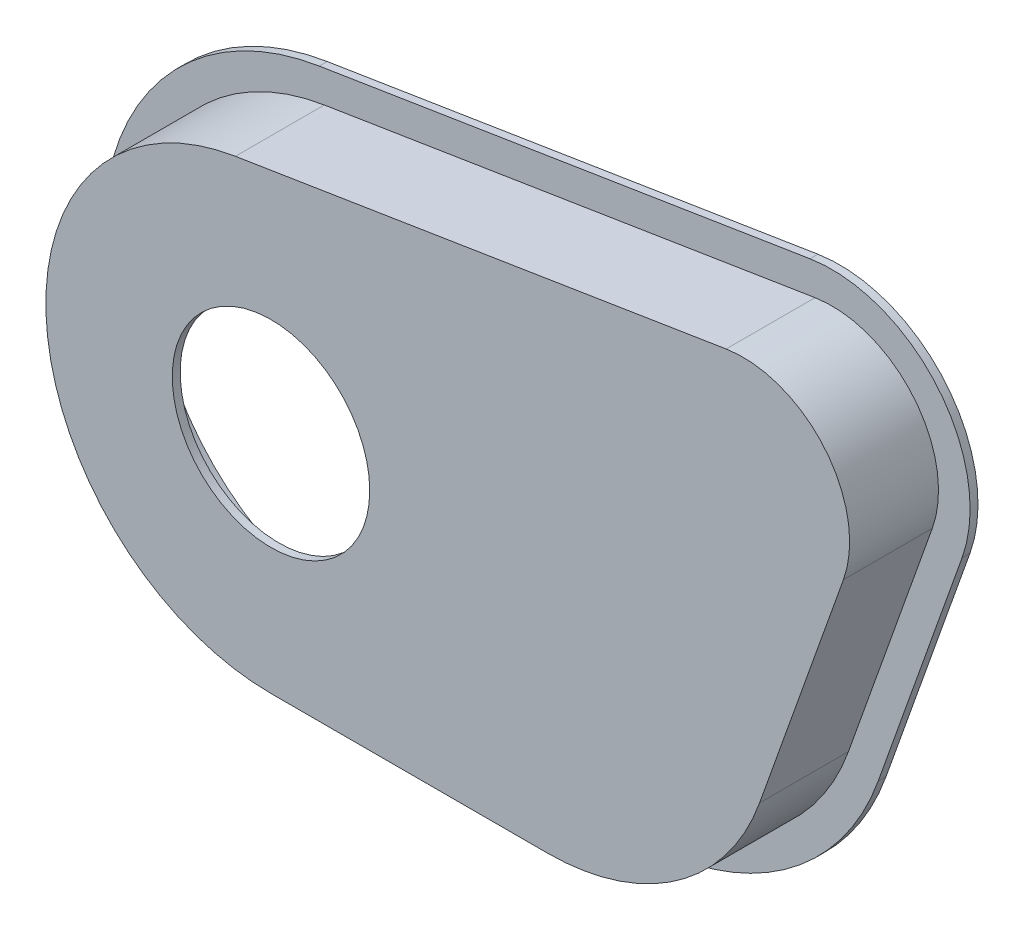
ISO-10303-21;
HEADER;
FILE_DESCRIPTION(('STEP AP214'),'2;1');
FILE_NAME('part.step','',(''),(''),'','','');
FILE_SCHEMA(('AUTOMOTIVE_DESIGN { 1 0 10303 214 1 1 1 1 }'));
ENDSEC;
DATA;
#1=APPLICATION_CONTEXT('core data for automotive mechanical design processes');
#2=APPLICATION_PROTOCOL_DEFINITION('international standard','automotive_design',2000,#1);
#3=PRODUCT_CONTEXT('',#1,'mechanical');
#4=PRODUCT('Part','Part','',(#3));
#5=PRODUCT_RELATED_PRODUCT_CATEGORY('part','',(#4));
#6=PRODUCT_DEFINITION_FORMATION('','',#4);
#7=PRODUCT_DEFINITION_CONTEXT('part definition',#1,'design');
#8=PRODUCT_DEFINITION('design','',#6,#7);
#9=PRODUCT_DEFINITION_SHAPE('','',#8);
#10=(LENGTH_UNIT() NAMED_UNIT(*) SI_UNIT(.MILLI.,.METRE.));
#11=(NAMED_UNIT(*) PLANE_ANGLE_UNIT() SI_UNIT($,.RADIAN.));
#12=(NAMED_UNIT(*) SI_UNIT($,.STERADIAN.) SOLID_ANGLE_UNIT());
#13=UNCERTAINTY_MEASURE_WITH_UNIT(LENGTH_MEASURE(1.E-05),#10,'distance_accuracy_value','');
#14=(GEOMETRIC_REPRESENTATION_CONTEXT(3) GLOBAL_UNCERTAINTY_ASSIGNED_CONTEXT((#13)) GLOBAL_UNIT_ASSIGNED_CONTEXT((#10,
#11,#12)) REPRESENTATION_CONTEXT('',''));
#15=CARTESIAN_POINT('',(0.,0.,0.));
#16=DIRECTION('',(0.,0.,1.));
#17=DIRECTION('',(1.,0.,0.));
#18=AXIS2_PLACEMENT_3D('',#15,#16,#17);
#19=CARTESIAN_POINT('',(151.761792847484,62.8617928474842,28.575));
#20=DIRECTION('',(0.,0.,-1.));
#21=DIRECTION('',(-1.,0.,0.));
#22=AXIS2_PLACEMENT_3D('',#19,#20,#21);
#23=CYLINDRICAL_SURFACE('',#22,34.29);
#24=CARTESIAN_POINT('',(151.761792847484,62.8617928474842,2.54));
#25=DIRECTION('',(0.,0.,-1.));
#26=DIRECTION('',(-1.,0.,0.));
#27=AXIS2_PLACEMENT_3D('',#24,#25,#26);
#28=CIRCLE('',#27,34.29);
#29=CARTESIAN_POINT('',(146.345280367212,96.7212891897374,2.54));
#30=VERTEX_POINT('',#29);
#31=CARTESIAN_POINT('',(184.06030948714,51.3461546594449,2.54));
#32=VERTEX_POINT('',#31);
#33=EDGE_CURVE('E46',#30,#32,#28,.T.);
#34=ORIENTED_EDGE('',*,*,#33,.F.);
#35=DIRECTION('',(0.,0.,-1.));
#36=VECTOR('',#35,1.);
#37=CARTESIAN_POINT('',(146.345280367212,96.7212891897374,28.575));
#38=LINE('',#37,#36);
#39=CARTESIAN_POINT('',(146.345280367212,96.7212891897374,31.115));
#40=VERTEX_POINT('',#39);
#41=EDGE_CURVE('E11',#40,#30,#38,.T.);
#42=ORIENTED_EDGE('',*,*,#41,.F.);
#43=CARTESIAN_POINT('',(151.761792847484,62.8617928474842,31.115));
#44=DIRECTION('',(0.,0.,1.));
#45=DIRECTION('',(1.,0.,0.));
#46=AXIS2_PLACEMENT_3D('',#43,#44,#45);
#47=CIRCLE('',#46,34.29);
#48=CARTESIAN_POINT('',(184.06030948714,51.3461546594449,31.115));
#49=VERTEX_POINT('',#48);
#50=EDGE_CURVE('E235',#49,#40,#47,.T.);
#51=ORIENTED_EDGE('',*,*,#50,.F.);
#52=DIRECTION('',(0.,0.,-1.));
#53=VECTOR('',#52,1.);
#54=CARTESIAN_POINT('',(184.06030948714,51.3461546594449,28.575));
#55=LINE('',#54,#53);
#56=EDGE_CURVE('E291',#49,#32,#55,.T.);
#57=ORIENTED_EDGE('',*,*,#56,.T.);
#58=EDGE_LOOP('',(#34,#42,#51,#57));
#59=FACE_BOUND('',#58,.T.);
#60=ADVANCED_FACE('F32',(#59),#23,.T.);
#61=CARTESIAN_POINT('',(146.345280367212,96.7212891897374,28.575));
#62=DIRECTION('',(0.15796186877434,-0.987445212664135,0.));
#63=DIRECTION('',(0.987445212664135,0.15796186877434,0.));
#64=AXIS2_PLACEMENT_3D('',#61,#62,#63);
#65=PLANE('',#64);
#66=DIRECTION('',(0.987445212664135,0.15796186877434,0.));
#67=VECTOR('',#66,1.);
#68=CARTESIAN_POINT('',(146.345280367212,96.7212891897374,2.54));
#69=LINE('',#68,#67);
#70=CARTESIAN_POINT('',(-11.4348596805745,71.4811589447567,2.54));
#71=VERTEX_POINT('',#70);
#72=EDGE_CURVE('E52',#71,#30,#69,.T.);
#73=ORIENTED_EDGE('',*,*,#72,.F.);
#74=DIRECTION('',(0.,0.,-1.));
#75=VECTOR('',#74,1.);
#76=CARTESIAN_POINT('',(-11.4348596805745,71.4811589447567,28.575));
#77=LINE('',#76,#75);
#78=CARTESIAN_POINT('',(-11.4348596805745,71.4811589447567,31.115));
#79=VERTEX_POINT('',#78);
#80=EDGE_CURVE('E39',#79,#71,#77,.T.);
#81=ORIENTED_EDGE('',*,*,#80,.F.);
#82=DIRECTION('',(-0.987445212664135,-0.15796186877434,0.));
#83=VECTOR('',#82,1.);
#84=CARTESIAN_POINT('',(-11.4348596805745,71.4811589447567,31.115));
#85=LINE('',#84,#83);
#86=EDGE_CURVE('E238',#40,#79,#85,.T.);
#87=ORIENTED_EDGE('',*,*,#86,.F.);
#88=ORIENTED_EDGE('',*,*,#41,.T.);
#89=EDGE_LOOP('',(#73,#81,#87,#88));
#90=FACE_BOUND('',#89,.T.);
#91=ADVANCED_FACE('F325',(#90),#65,.F.);
#92=CARTESIAN_POINT('',(0.,0.,28.575));
#93=DIRECTION('',(0.,0.,-1.));
#94=DIRECTION('',(-1.,0.,0.));
#95=AXIS2_PLACEMENT_3D('',#92,#93,#94);
#96=CYLINDRICAL_SURFACE('',#95,72.39);
#97=CARTESIAN_POINT('',(0.,0.,2.54));
#98=DIRECTION('',(0.,0.,-1.));
#99=DIRECTION('',(-1.,0.,0.));
#100=AXIS2_PLACEMENT_3D('',#97,#98,#99);
#101=CIRCLE('',#100,72.39);
#102=CARTESIAN_POINT('',(7.58245002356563E-13,-72.39,2.54));
#103=VERTEX_POINT('',#102);
#104=EDGE_CURVE('E304',#103,#71,#101,.T.);
#105=ORIENTED_EDGE('',*,*,#104,.F.);
#106=DIRECTION('',(0.,0.,-1.));
#107=VECTOR('',#106,1.);
#108=CARTESIAN_POINT('',(7.58245002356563E-13,-72.39,28.575));
#109=LINE('',#108,#107);
#110=CARTESIAN_POINT('',(7.58245002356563E-13,-72.39,31.115));
#111=VERTEX_POINT('',#110);
#112=EDGE_CURVE('E298',#111,#103,#109,.T.);
#113=ORIENTED_EDGE('',*,*,#112,.F.);
#114=CARTESIAN_POINT('',(0.,0.,31.115));
#115=DIRECTION('',(0.,0.,1.));
#116=DIRECTION('',(1.,0.,0.));
#117=AXIS2_PLACEMENT_3D('',#114,#115,#116);
#118=CIRCLE('',#117,72.39);
#119=EDGE_CURVE('E221',#79,#111,#118,.T.);
#120=ORIENTED_EDGE('',*,*,#119,.F.);
#121=ORIENTED_EDGE('',*,*,#80,.T.);
#122=EDGE_LOOP('',(#105,#113,#120,#121));
#123=FACE_BOUND('',#122,.T.);
#124=ADVANCED_FACE('F303',(#123),#96,.T.);
#125=CARTESIAN_POINT('',(7.58245002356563E-13,-72.39,28.575));
#126=DIRECTION('',(0.,1.,0.));
#127=DIRECTION('',(-1.,0.,0.));
#128=AXIS2_PLACEMENT_3D('',#125,#126,#127);
#129=PLANE('',#128);
#130=DIRECTION('',(-1.,0.,0.));
#131=VECTOR('',#130,1.);
#132=CARTESIAN_POINT('',(88.9,-72.39,2.54));
#133=LINE('',#132,#131);
#134=CARTESIAN_POINT('',(88.9,-72.39,2.54));
#135=VERTEX_POINT('',#134);
#136=EDGE_CURVE('E309',#135,#103,#133,.T.);
#137=ORIENTED_EDGE('',*,*,#136,.F.);
#138=DIRECTION('',(0.,0.,-1.));
#139=VECTOR('',#138,1.);
#140=CARTESIAN_POINT('',(88.9,-72.39,28.575));
#141=LINE('',#140,#139);
#142=CARTESIAN_POINT('',(88.9,-72.39,31.115));
#143=VERTEX_POINT('',#142);
#144=EDGE_CURVE('E295',#143,#135,#141,.T.);
#145=ORIENTED_EDGE('',*,*,#144,.F.);
#146=DIRECTION('',(1.,0.,0.));
#147=VECTOR('',#146,1.);
#148=CARTESIAN_POINT('',(7.58245002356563E-13,-72.39,31.115));
#149=LINE('',#148,#147);
#150=EDGE_CURVE('E226',#111,#143,#149,.T.);
#151=ORIENTED_EDGE('',*,*,#150,.F.);
#152=ORIENTED_EDGE('',*,*,#112,.T.);
#153=EDGE_LOOP('',(#137,#145,#151,#152));
#154=FACE_BOUND('',#153,.T.);
#155=ADVANCED_FACE('F331',(#154),#129,.F.);
#156=CARTESIAN_POINT('',(88.9,0.,28.575));
#157=DIRECTION('',(0.,0.,-1.));
#158=DIRECTION('',(-1.,0.,0.));
#159=AXIS2_PLACEMENT_3D('',#156,#157,#158);
#160=CYLINDRICAL_SURFACE('',#159,72.39);
#161=CARTESIAN_POINT('',(88.9,0.,2.54));
#162=DIRECTION('',(0.,0.,-1.));
#163=DIRECTION('',(-1.,0.,0.));
#164=AXIS2_PLACEMENT_3D('',#161,#162,#163);
#165=CIRCLE('',#164,72.39);
#166=CARTESIAN_POINT('',(157.085757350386,-24.3107917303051,2.54));
#167=VERTEX_POINT('',#166);
#168=EDGE_CURVE('E310',#167,#135,#165,.T.);
#169=ORIENTED_EDGE('',*,*,#168,.F.);
#170=DIRECTION('',(0.,0.,-1.));
#171=VECTOR('',#170,1.);
#172=CARTESIAN_POINT('',(157.085757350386,-24.3107917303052,28.575));
#173=LINE('',#172,#171);
#174=CARTESIAN_POINT('',(157.085757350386,-24.3107917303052,31.115));
#175=VERTEX_POINT('',#174);
#176=EDGE_CURVE('E293',#175,#167,#173,.T.);
#177=ORIENTED_EDGE('',*,*,#176,.F.);
#178=CARTESIAN_POINT('',(88.9,0.,31.115));
#179=DIRECTION('',(0.,0.,1.));
#180=DIRECTION('',(1.,0.,0.));
#181=AXIS2_PLACEMENT_3D('',#178,#179,#180);
#182=CIRCLE('',#181,72.39);
#183=EDGE_CURVE('E229',#143,#175,#182,.T.);
#184=ORIENTED_EDGE('',*,*,#183,.F.);
#185=ORIENTED_EDGE('',*,*,#144,.T.);
#186=EDGE_LOOP('',(#169,#177,#184,#185));
#187=FACE_BOUND('',#186,.T.);
#188=ADVANCED_FACE('F336',(#187),#160,.T.);
#189=CARTESIAN_POINT('',(184.06030948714,51.3461546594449,28.575));
#190=DIRECTION('',(-0.941922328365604,0.335830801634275,0.));
#191=DIRECTION('',(-0.335830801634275,-0.941922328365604,0.));
#192=AXIS2_PLACEMENT_3D('',#189,#190,#191);
#193=PLANE('',#192);
#194=DIRECTION('',(-0.335830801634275,-0.941922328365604,0.));
#195=VECTOR('',#194,1.);
#196=CARTESIAN_POINT('',(184.06030948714,51.3461546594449,2.54));
#197=LINE('',#196,#195);
#198=EDGE_CURVE('E314',#32,#167,#197,.T.);
#199=ORIENTED_EDGE('',*,*,#198,.F.);
#200=ORIENTED_EDGE('',*,*,#56,.F.);
#201=DIRECTION('',(0.335830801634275,0.941922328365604,0.));
#202=VECTOR('',#201,1.);
#203=CARTESIAN_POINT('',(157.085757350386,-24.3107917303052,31.115));
#204=LINE('',#203,#202);
#205=EDGE_CURVE('E232',#175,#49,#204,.T.);
#206=ORIENTED_EDGE('',*,*,#205,.F.);
#207=ORIENTED_EDGE('',*,*,#176,.T.);
#208=EDGE_LOOP('',(#199,#200,#206,#207));
#209=FACE_BOUND('',#208,.T.);
#210=ADVANCED_FACE('F319',(#209),#193,.F.);
#211=CARTESIAN_POINT('',(151.761792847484,62.8617928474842,0.));
#212=DIRECTION('',(0.,0.,1.));
#213=DIRECTION('',(1.,0.,0.));
#214=AXIS2_PLACEMENT_3D('',#211,#212,#213);
#215=PLANE('',#214);
#216=CARTESIAN_POINT('',(0.,0.,0.));
#217=DIRECTION('',(0.,0.,1.));
#218=DIRECTION('',(1.,0.,0.));
#219=AXIS2_PLACEMENT_3D('',#216,#217,#218);
#220=CIRCLE('',#219,69.85);
#221=CARTESIAN_POINT('',(-11.0336365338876,68.9730481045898,0.));
#222=VERTEX_POINT('',#221);
#223=CARTESIAN_POINT('',(7.31639914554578E-13,-69.85,0.));
#224=VERTEX_POINT('',#223);
#225=EDGE_CURVE('E241',#222,#224,#220,.T.);
#226=ORIENTED_EDGE('',*,*,#225,.T.);
#227=DIRECTION('',(1.,0.,0.));
#228=VECTOR('',#227,1.);
#229=CARTESIAN_POINT('',(88.9,-69.85,0.));
#230=LINE('',#229,#228);
#231=CARTESIAN_POINT('',(88.9,-69.85,0.));
#232=VERTEX_POINT('',#231);
#233=EDGE_CURVE('E264',#224,#232,#230,.T.);
#234=ORIENTED_EDGE('',*,*,#233,.T.);
#235=CARTESIAN_POINT('',(88.9,0.,0.));
#236=DIRECTION('',(0.,0.,1.));
#237=DIRECTION('',(1.,0.,0.));
#238=AXIS2_PLACEMENT_3D('',#235,#236,#237);
#239=CIRCLE('',#238,69.85);
#240=CARTESIAN_POINT('',(154.693274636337,-23.4577814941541,0.));
#241=VERTEX_POINT('',#240);
#242=EDGE_CURVE('E267',#232,#241,#239,.T.);
#243=ORIENTED_EDGE('',*,*,#242,.T.);
#244=DIRECTION('',(0.335830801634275,0.941922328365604,0.));
#245=VECTOR('',#244,1.);
#246=CARTESIAN_POINT('',(181.667826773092,52.199164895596,0.));
#247=LINE('',#246,#245);
#248=CARTESIAN_POINT('',(181.667826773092,52.199164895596,0.));
#249=VERTEX_POINT('',#248);
#250=EDGE_CURVE('E270',#241,#249,#247,.T.);
#251=ORIENTED_EDGE('',*,*,#250,.T.);
#252=CARTESIAN_POINT('',(151.761792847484,62.8617928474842,0.));
#253=DIRECTION('',(0.,0.,1.));
#254=DIRECTION('',(1.,0.,0.));
#255=AXIS2_PLACEMENT_3D('',#252,#253,#254);
#256=CIRCLE('',#255,31.75);
#257=CARTESIAN_POINT('',(146.746503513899,94.2131783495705,0.));
#258=VERTEX_POINT('',#257);
#259=EDGE_CURVE('E273',#249,#258,#256,.T.);
#260=ORIENTED_EDGE('',*,*,#259,.T.);
#261=DIRECTION('',(-0.987445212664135,-0.15796186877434,0.));
#262=VECTOR('',#261,1.);
#263=CARTESIAN_POINT('',(-11.0336365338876,68.9730481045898,0.));
#264=LINE('',#263,#262);
#265=EDGE_CURVE('E246',#258,#222,#264,.T.);
#266=ORIENTED_EDGE('',*,*,#265,.T.);
#267=EDGE_LOOP('',(#226,#234,#243,#251,#260,#266));
#268=FACE_BOUND('',#267,.T.);
#269=CARTESIAN_POINT('',(151.761792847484,62.8617928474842,0.));
#270=DIRECTION('',(0.,0.,-1.));
#271=DIRECTION('',(-1.,0.,0.));
#272=AXIS2_PLACEMENT_3D('',#269,#270,#271);
#273=CIRCLE('',#272,44.45);
#274=CARTESIAN_POINT('',(144.740387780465,106.753732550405,0.));
#275=VERTEX_POINT('',#274);
#276=CARTESIAN_POINT('',(193.630240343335,47.9341137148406,0.));
#277=VERTEX_POINT('',#276);
#278=EDGE_CURVE('E198',#275,#277,#273,.T.);
#279=ORIENTED_EDGE('',*,*,#278,.T.);
#280=DIRECTION('',(-0.335830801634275,-0.941922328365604,0.));
#281=VECTOR('',#280,1.);
#282=CARTESIAN_POINT('',(193.630240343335,47.9341137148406,0.));
#283=LINE('',#282,#281);
#284=CARTESIAN_POINT('',(166.655688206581,-27.7228326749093,0.));
#285=VERTEX_POINT('',#284);
#286=EDGE_CURVE('E161',#277,#285,#283,.T.);
#287=ORIENTED_EDGE('',*,*,#286,.T.);
#288=CARTESIAN_POINT('',(88.9,0.,0.));
#289=DIRECTION('',(0.,0.,-1.));
#290=DIRECTION('',(-1.,0.,0.));
#291=AXIS2_PLACEMENT_3D('',#288,#289,#290);
#292=CIRCLE('',#291,82.55);
#293=CARTESIAN_POINT('',(88.9,-82.55,0.));
#294=VERTEX_POINT('',#293);
#295=EDGE_CURVE('E201',#285,#294,#292,.T.);
#296=ORIENTED_EDGE('',*,*,#295,.T.);
#297=DIRECTION('',(-1.,0.,0.));
#298=VECTOR('',#297,1.);
#299=CARTESIAN_POINT('',(88.9,-82.55,0.));
#300=LINE('',#299,#298);
#301=CARTESIAN_POINT('',(8.94993731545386E-13,-82.55,0.));
#302=VERTEX_POINT('',#301);
#303=EDGE_CURVE('E204',#294,#302,#300,.T.);
#304=ORIENTED_EDGE('',*,*,#303,.T.);
#305=CARTESIAN_POINT('',(0.,0.,0.));
#306=DIRECTION('',(0.,0.,-1.));
#307=DIRECTION('',(-1.,0.,0.));
#308=AXIS2_PLACEMENT_3D('',#305,#306,#307);
#309=CIRCLE('',#308,82.55);
#310=CARTESIAN_POINT('',(-13.0397522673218,81.5136023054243,0.));
#311=VERTEX_POINT('',#310);
#312=EDGE_CURVE('E185',#302,#311,#309,.T.);
#313=ORIENTED_EDGE('',*,*,#312,.T.);
#314=DIRECTION('',(0.987445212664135,0.15796186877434,0.));
#315=VECTOR('',#314,1.);
#316=CARTESIAN_POINT('',(144.740387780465,106.753732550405,0.));
#317=LINE('',#316,#315);
#318=EDGE_CURVE('E182',#311,#275,#317,.T.);
#319=ORIENTED_EDGE('',*,*,#318,.T.);
#320=EDGE_LOOP('',(#279,#287,#296,#304,#313,#319));
#321=FACE_BOUND('',#320,.T.);
#322=ADVANCED_FACE('F343',(#268,#321),#215,.F.);
#323=CARTESIAN_POINT('',(0.,0.,28.575));
#324=DIRECTION('',(0.,0.,-1.));
#325=DIRECTION('',(-1.,0.,0.));
#326=AXIS2_PLACEMENT_3D('',#323,#324,#325);
#327=CYLINDRICAL_SURFACE('',#326,69.85);
#328=ORIENTED_EDGE('',*,*,#225,.F.);
#329=DIRECTION('',(0.,0.,-1.));
#330=VECTOR('',#329,1.);
#331=CARTESIAN_POINT('',(-11.0336365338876,68.9730481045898,28.575));
#332=LINE('',#331,#330);
#333=CARTESIAN_POINT('',(-11.0336365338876,68.9730481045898,28.575));
#334=VERTEX_POINT('',#333);
#335=EDGE_CURVE('E261',#334,#222,#332,.T.);
#336=ORIENTED_EDGE('',*,*,#335,.F.);
#337=CARTESIAN_POINT('',(0.,0.,28.575));
#338=DIRECTION('',(0.,0.,1.));
#339=DIRECTION('',(1.,0.,0.));
#340=AXIS2_PLACEMENT_3D('',#337,#338,#339);
#341=CIRCLE('',#340,69.85);
#342=CARTESIAN_POINT('',(7.35522753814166E-13,-69.85,28.575));
#343=VERTEX_POINT('',#342);
#344=EDGE_CURVE('E242',#334,#343,#341,.T.);
#345=ORIENTED_EDGE('',*,*,#344,.T.);
#346=DIRECTION('',(0.,0.,-1.));
#347=VECTOR('',#346,1.);
#348=CARTESIAN_POINT('',(7.31639914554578E-13,-69.85,28.575));
#349=LINE('',#348,#347);
#350=EDGE_CURVE('E288',#343,#224,#349,.T.);
#351=ORIENTED_EDGE('',*,*,#350,.T.);
#352=EDGE_LOOP('',(#328,#336,#345,#351));
#353=FACE_BOUND('',#352,.T.);
#354=ADVANCED_FACE('F346',(#353),#327,.F.);
#355=CARTESIAN_POINT('',(88.9,-69.85,28.575));
#356=DIRECTION('',(0.,1.,0.));
#357=DIRECTION('',(-1.,0.,0.));
#358=AXIS2_PLACEMENT_3D('',#355,#356,#357);
#359=PLANE('',#358);
#360=ORIENTED_EDGE('',*,*,#233,.F.);
#361=ORIENTED_EDGE('',*,*,#350,.F.);
#362=DIRECTION('',(1.,0.,0.));
#363=VECTOR('',#362,1.);
#364=CARTESIAN_POINT('',(88.9,-69.85,28.575));
#365=LINE('',#364,#363);
#366=CARTESIAN_POINT('',(88.9,-69.85,28.575));
#367=VERTEX_POINT('',#366);
#368=EDGE_CURVE('E245',#343,#367,#365,.T.);
#369=ORIENTED_EDGE('',*,*,#368,.T.);
#370=DIRECTION('',(0.,0.,-1.));
#371=VECTOR('',#370,1.);
#372=CARTESIAN_POINT('',(88.9,-69.85,28.575));
#373=LINE('',#372,#371);
#374=EDGE_CURVE('E286',#367,#232,#373,.T.);
#375=ORIENTED_EDGE('',*,*,#374,.T.);
#376=EDGE_LOOP('',(#360,#361,#369,#375));
#377=FACE_BOUND('',#376,.T.);
#378=ADVANCED_FACE('F350',(#377),#359,.T.);
#379=CARTESIAN_POINT('',(88.9,0.,28.575));
#380=DIRECTION('',(0.,0.,-1.));
#381=DIRECTION('',(-1.,0.,0.));
#382=AXIS2_PLACEMENT_3D('',#379,#380,#381);
#383=CYLINDRICAL_SURFACE('',#382,69.85);
#384=ORIENTED_EDGE('',*,*,#242,.F.);
#385=ORIENTED_EDGE('',*,*,#374,.F.);
#386=CARTESIAN_POINT('',(88.9,0.,28.575));
#387=DIRECTION('',(0.,0.,1.));
#388=DIRECTION('',(1.,0.,0.));
#389=AXIS2_PLACEMENT_3D('',#386,#387,#388);
#390=CIRCLE('',#389,69.85);
#391=CARTESIAN_POINT('',(154.693274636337,-23.4577814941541,28.575));
#392=VERTEX_POINT('',#391);
#393=EDGE_CURVE('E249',#367,#392,#390,.T.);
#394=ORIENTED_EDGE('',*,*,#393,.T.);
#395=DIRECTION('',(0.,0.,-1.));
#396=VECTOR('',#395,1.);
#397=CARTESIAN_POINT('',(154.693274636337,-23.4577814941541,28.575));
#398=LINE('',#397,#396);
#399=EDGE_CURVE('E284',#392,#241,#398,.T.);
#400=ORIENTED_EDGE('',*,*,#399,.T.);
#401=EDGE_LOOP('',(#384,#385,#394,#400));
#402=FACE_BOUND('',#401,.T.);
#403=ADVANCED_FACE('F354',(#402),#383,.F.);
#404=CARTESIAN_POINT('',(181.667826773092,52.199164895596,28.575));
#405=DIRECTION('',(-0.941922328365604,0.335830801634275,0.));
#406=DIRECTION('',(-0.335830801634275,-0.941922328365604,0.));
#407=AXIS2_PLACEMENT_3D('',#404,#405,#406);
#408=PLANE('',#407);
#409=ORIENTED_EDGE('',*,*,#250,.F.);
#410=ORIENTED_EDGE('',*,*,#399,.F.);
#411=DIRECTION('',(0.335830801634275,0.941922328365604,0.));
#412=VECTOR('',#411,1.);
#413=CARTESIAN_POINT('',(181.667826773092,52.199164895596,28.575));
#414=LINE('',#413,#412);
#415=CARTESIAN_POINT('',(181.667826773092,52.199164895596,28.575));
#416=VERTEX_POINT('',#415);
#417=EDGE_CURVE('E252',#392,#416,#414,.T.);
#418=ORIENTED_EDGE('',*,*,#417,.T.);
#419=DIRECTION('',(0.,0.,-1.));
#420=VECTOR('',#419,1.);
#421=CARTESIAN_POINT('',(181.667826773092,52.199164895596,28.575));
#422=LINE('',#421,#420);
#423=EDGE_CURVE('E282',#416,#249,#422,.T.);
#424=ORIENTED_EDGE('',*,*,#423,.T.);
#425=EDGE_LOOP('',(#409,#410,#418,#424));
#426=FACE_BOUND('',#425,.T.);
#427=ADVANCED_FACE('F358',(#426),#408,.T.);
#428=CARTESIAN_POINT('',(151.761792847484,62.8617928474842,28.575));
#429=DIRECTION('',(0.,0.,-1.));
#430=DIRECTION('',(-1.,0.,0.));
#431=AXIS2_PLACEMENT_3D('',#428,#429,#430);
#432=CYLINDRICAL_SURFACE('',#431,31.75);
#433=ORIENTED_EDGE('',*,*,#259,.F.);
#434=ORIENTED_EDGE('',*,*,#423,.F.);
#435=CARTESIAN_POINT('',(151.761792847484,62.8617928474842,28.575));
#436=DIRECTION('',(0.,0.,1.));
#437=DIRECTION('',(1.,0.,0.));
#438=AXIS2_PLACEMENT_3D('',#435,#436,#437);
#439=CIRCLE('',#438,31.75);
#440=CARTESIAN_POINT('',(146.746503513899,94.2131783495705,28.575));
#441=VERTEX_POINT('',#440);
#442=EDGE_CURVE('E255',#416,#441,#439,.T.);
#443=ORIENTED_EDGE('',*,*,#442,.T.);
#444=DIRECTION('',(0.,0.,-1.));
#445=VECTOR('',#444,1.);
#446=CARTESIAN_POINT('',(146.746503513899,94.2131783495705,28.575));
#447=LINE('',#446,#445);
#448=EDGE_CURVE('E280',#441,#258,#447,.T.);
#449=ORIENTED_EDGE('',*,*,#448,.T.);
#450=EDGE_LOOP('',(#433,#434,#443,#449));
#451=FACE_BOUND('',#450,.T.);
#452=ADVANCED_FACE('F362',(#451),#432,.F.);
#453=CARTESIAN_POINT('',(-11.0336365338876,68.9730481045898,28.575));
#454=DIRECTION('',(0.15796186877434,-0.987445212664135,0.));
#455=DIRECTION('',(0.987445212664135,0.15796186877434,0.));
#456=AXIS2_PLACEMENT_3D('',#453,#454,#455);
#457=PLANE('',#456);
#458=ORIENTED_EDGE('',*,*,#265,.F.);
#459=ORIENTED_EDGE('',*,*,#448,.F.);
#460=DIRECTION('',(-0.987445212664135,-0.15796186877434,0.));
#461=VECTOR('',#460,1.);
#462=CARTESIAN_POINT('',(-11.0336365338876,68.9730481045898,28.575));
#463=LINE('',#462,#461);
#464=EDGE_CURVE('E258',#441,#334,#463,.T.);
#465=ORIENTED_EDGE('',*,*,#464,.T.);
#466=ORIENTED_EDGE('',*,*,#335,.T.);
#467=EDGE_LOOP('',(#458,#459,#465,#466));
#468=FACE_BOUND('',#467,.T.);
#469=ADVANCED_FACE('F366',(#468),#457,.T.);
#470=CARTESIAN_POINT('',(0.,0.,31.115));
#471=DIRECTION('',(0.,0.,1.));
#472=DIRECTION('',(1.,0.,0.));
#473=AXIS2_PLACEMENT_3D('',#470,#471,#472);
#474=PLANE('',#473);
#475=ORIENTED_EDGE('',*,*,#119,.T.);
#476=ORIENTED_EDGE('',*,*,#150,.T.);
#477=ORIENTED_EDGE('',*,*,#183,.T.);
#478=ORIENTED_EDGE('',*,*,#205,.T.);
#479=ORIENTED_EDGE('',*,*,#50,.T.);
#480=ORIENTED_EDGE('',*,*,#86,.T.);
#481=EDGE_LOOP('',(#475,#476,#477,#478,#479,#480));
#482=FACE_BOUND('',#481,.T.);
#483=CARTESIAN_POINT('',(0.,0.,31.115));
#484=DIRECTION('',(0.,0.,1.));
#485=DIRECTION('',(1.,0.,0.));
#486=AXIS2_PLACEMENT_3D('',#483,#484,#485);
#487=CIRCLE('',#486,31.75);
#488=CARTESIAN_POINT('',(31.75,0.,31.115));
#489=VERTEX_POINT('',#488);
#490=EDGE_CURVE('E218',#489,#489,#487,.T.);
#491=ORIENTED_EDGE('',*,*,#490,.F.);
#492=EDGE_LOOP('',(#491));
#493=FACE_BOUND('',#492,.T.);
#494=ADVANCED_FACE('F323',(#482,#493),#474,.T.);
#495=CARTESIAN_POINT('',(0.,0.,28.575));
#496=DIRECTION('',(0.,0.,1.));
#497=DIRECTION('',(1.,0.,0.));
#498=AXIS2_PLACEMENT_3D('',#495,#496,#497);
#499=PLANE('',#498);
#500=ORIENTED_EDGE('',*,*,#344,.F.);
#501=ORIENTED_EDGE('',*,*,#464,.F.);
#502=ORIENTED_EDGE('',*,*,#442,.F.);
#503=ORIENTED_EDGE('',*,*,#417,.F.);
#504=ORIENTED_EDGE('',*,*,#393,.F.);
#505=ORIENTED_EDGE('',*,*,#368,.F.);
#506=EDGE_LOOP('',(#500,#501,#502,#503,#504,#505));
#507=FACE_BOUND('',#506,.T.);
#508=CARTESIAN_POINT('',(0.,0.,28.575));
#509=DIRECTION('',(0.,0.,1.));
#510=DIRECTION('',(1.,0.,0.));
#511=AXIS2_PLACEMENT_3D('',#508,#509,#510);
#512=CIRCLE('',#511,31.75);
#513=CARTESIAN_POINT('',(31.75,0.,28.575));
#514=VERTEX_POINT('',#513);
#515=EDGE_CURVE('E210',#514,#514,#512,.T.);
#516=ORIENTED_EDGE('',*,*,#515,.T.);
#517=EDGE_LOOP('',(#516));
#518=FACE_BOUND('',#517,.T.);
#519=ADVANCED_FACE('F371',(#507,#518),#499,.F.);
#520=CARTESIAN_POINT('',(0.,0.,31.115));
#521=DIRECTION('',(0.,0.,-1.));
#522=DIRECTION('',(-1.,0.,0.));
#523=AXIS2_PLACEMENT_3D('',#520,#521,#522);
#524=CYLINDRICAL_SURFACE('',#523,31.75);
#525=ORIENTED_EDGE('',*,*,#490,.T.);
#526=EDGE_LOOP('',(#525));
#527=FACE_BOUND('',#526,.T.);
#528=ORIENTED_EDGE('',*,*,#515,.F.);
#529=EDGE_LOOP('',(#528));
#530=FACE_BOUND('',#529,.T.);
#531=ADVANCED_FACE('F374',(#527,#530),#524,.F.);
#532=CARTESIAN_POINT('',(151.761792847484,62.8617928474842,2.54));
#533=DIRECTION('',(0.,0.,-1.));
#534=DIRECTION('',(-1.,0.,0.));
#535=AXIS2_PLACEMENT_3D('',#532,#533,#534);
#536=CYLINDRICAL_SURFACE('',#535,44.45);
#537=ORIENTED_EDGE('',*,*,#278,.F.);
#538=DIRECTION('',(0.,0.,-1.));
#539=VECTOR('',#538,1.);
#540=CARTESIAN_POINT('',(144.740387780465,106.753732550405,2.54));
#541=LINE('',#540,#539);
#542=CARTESIAN_POINT('',(144.740387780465,106.753732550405,2.54));
#543=VERTEX_POINT('',#542);
#544=EDGE_CURVE('E181',#543,#275,#541,.T.);
#545=ORIENTED_EDGE('',*,*,#544,.F.);
#546=CARTESIAN_POINT('',(151.761792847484,62.8617928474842,2.54));
#547=DIRECTION('',(0.,0.,-1.));
#548=DIRECTION('',(-1.,0.,0.));
#549=AXIS2_PLACEMENT_3D('',#546,#547,#548);
#550=CIRCLE('',#549,44.45);
#551=CARTESIAN_POINT('',(193.630240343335,47.9341137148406,2.54));
#552=VERTEX_POINT('',#551);
#553=EDGE_CURVE('E174',#543,#552,#550,.T.);
#554=ORIENTED_EDGE('',*,*,#553,.T.);
#555=DIRECTION('',(0.,0.,-1.));
#556=VECTOR('',#555,1.);
#557=CARTESIAN_POINT('',(193.630240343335,47.9341137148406,2.54));
#558=LINE('',#557,#556);
#559=EDGE_CURVE('E156',#552,#277,#558,.T.);
#560=ORIENTED_EDGE('',*,*,#559,.T.);
#561=EDGE_LOOP('',(#537,#545,#554,#560));
#562=FACE_BOUND('',#561,.T.);
#563=ADVANCED_FACE('F180',(#562),#536,.T.);
#564=CARTESIAN_POINT('',(144.740387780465,106.753732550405,2.54));
#565=DIRECTION('',(-0.15796186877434,0.987445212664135,0.));
#566=DIRECTION('',(-0.987445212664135,-0.15796186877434,0.));
#567=AXIS2_PLACEMENT_3D('',#564,#565,#566);
#568=PLANE('',#567);
#569=ORIENTED_EDGE('',*,*,#318,.F.);
#570=DIRECTION('',(0.,0.,-1.));
#571=VECTOR('',#570,1.);
#572=CARTESIAN_POINT('',(-13.0397522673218,81.5136023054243,2.54));
#573=LINE('',#572,#571);
#574=CARTESIAN_POINT('',(-13.0397522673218,81.5136023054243,2.54));
#575=VERTEX_POINT('',#574);
#576=EDGE_CURVE('E211',#575,#311,#573,.T.);
#577=ORIENTED_EDGE('',*,*,#576,.F.);
#578=DIRECTION('',(0.987445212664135,0.15796186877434,0.));
#579=VECTOR('',#578,1.);
#580=CARTESIAN_POINT('',(144.740387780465,106.753732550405,2.54));
#581=LINE('',#580,#579);
#582=EDGE_CURVE('E167',#575,#543,#581,.T.);
#583=ORIENTED_EDGE('',*,*,#582,.T.);
#584=ORIENTED_EDGE('',*,*,#544,.T.);
#585=EDGE_LOOP('',(#569,#577,#583,#584));
#586=FACE_BOUND('',#585,.T.);
#587=ADVANCED_FACE('F383',(#586),#568,.T.);
#588=CARTESIAN_POINT('',(0.,0.,2.54));
#589=DIRECTION('',(0.,0.,-1.));
#590=DIRECTION('',(-1.,0.,0.));
#591=AXIS2_PLACEMENT_3D('',#588,#589,#590);
#592=CYLINDRICAL_SURFACE('',#591,82.55);
#593=ORIENTED_EDGE('',*,*,#312,.F.);
#594=DIRECTION('',(0.,0.,-1.));
#595=VECTOR('',#594,1.);
#596=CARTESIAN_POINT('',(8.94993731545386E-13,-82.55,2.54));
#597=LINE('',#596,#595);
#598=CARTESIAN_POINT('',(8.94993731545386E-13,-82.55,2.54));
#599=VERTEX_POINT('',#598);
#600=EDGE_CURVE('E213',#599,#302,#597,.T.);
#601=ORIENTED_EDGE('',*,*,#600,.F.);
#602=CARTESIAN_POINT('',(0.,0.,2.54));
#603=DIRECTION('',(0.,0.,-1.));
#604=DIRECTION('',(-1.,0.,0.));
#605=AXIS2_PLACEMENT_3D('',#602,#603,#604);
#606=CIRCLE('',#605,82.55);
#607=EDGE_CURVE('E194',#599,#575,#606,.T.);
#608=ORIENTED_EDGE('',*,*,#607,.T.);
#609=ORIENTED_EDGE('',*,*,#576,.T.);
#610=EDGE_LOOP('',(#593,#601,#608,#609));
#611=FACE_BOUND('',#610,.T.);
#612=ADVANCED_FACE('F393',(#611),#592,.T.);
#613=CARTESIAN_POINT('',(88.9,-82.55,2.54));
#614=DIRECTION('',(0.,-1.,0.));
#615=DIRECTION('',(1.,0.,0.));
#616=AXIS2_PLACEMENT_3D('',#613,#614,#615);
#617=PLANE('',#616);
#618=ORIENTED_EDGE('',*,*,#303,.F.);
#619=DIRECTION('',(0.,0.,-1.));
#620=VECTOR('',#619,1.);
#621=CARTESIAN_POINT('',(88.9,-82.55,2.54));
#622=LINE('',#621,#620);
#623=CARTESIAN_POINT('',(88.9,-82.55,2.54));
#624=VERTEX_POINT('',#623);
#625=EDGE_CURVE('E215',#624,#294,#622,.T.);
#626=ORIENTED_EDGE('',*,*,#625,.F.);
#627=DIRECTION('',(-1.,0.,0.));
#628=VECTOR('',#627,1.);
#629=CARTESIAN_POINT('',(88.9,-82.55,2.54));
#630=LINE('',#629,#628);
#631=EDGE_CURVE('E191',#624,#599,#630,.T.);
#632=ORIENTED_EDGE('',*,*,#631,.T.);
#633=ORIENTED_EDGE('',*,*,#600,.T.);
#634=EDGE_LOOP('',(#618,#626,#632,#633));
#635=FACE_BOUND('',#634,.T.);
#636=ADVANCED_FACE('F389',(#635),#617,.T.);
#637=CARTESIAN_POINT('',(88.9,0.,2.54));
#638=DIRECTION('',(0.,0.,-1.));
#639=DIRECTION('',(-1.,0.,0.));
#640=AXIS2_PLACEMENT_3D('',#637,#638,#639);
#641=CYLINDRICAL_SURFACE('',#640,82.55);
#642=ORIENTED_EDGE('',*,*,#295,.F.);
#643=DIRECTION('',(0.,0.,-1.));
#644=VECTOR('',#643,1.);
#645=CARTESIAN_POINT('',(166.655688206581,-27.7228326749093,2.54));
#646=LINE('',#645,#644);
#647=CARTESIAN_POINT('',(166.655688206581,-27.7228326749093,2.54));
#648=VERTEX_POINT('',#647);
#649=EDGE_CURVE('E166',#648,#285,#646,.T.);
#650=ORIENTED_EDGE('',*,*,#649,.F.);
#651=CARTESIAN_POINT('',(88.9,0.,2.54));
#652=DIRECTION('',(0.,0.,-1.));
#653=DIRECTION('',(-1.,0.,0.));
#654=AXIS2_PLACEMENT_3D('',#651,#652,#653);
#655=CIRCLE('',#654,82.55);
#656=EDGE_CURVE('E178',#648,#624,#655,.T.);
#657=ORIENTED_EDGE('',*,*,#656,.T.);
#658=ORIENTED_EDGE('',*,*,#625,.T.);
#659=EDGE_LOOP('',(#642,#650,#657,#658));
#660=FACE_BOUND('',#659,.T.);
#661=ADVANCED_FACE('F386',(#660),#641,.T.);
#662=CARTESIAN_POINT('',(193.630240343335,47.9341137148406,2.54));
#663=DIRECTION('',(0.941922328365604,-0.335830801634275,0.));
#664=DIRECTION('',(0.335830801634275,0.941922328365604,0.));
#665=AXIS2_PLACEMENT_3D('',#662,#663,#664);
#666=PLANE('',#665);
#667=ORIENTED_EDGE('',*,*,#286,.F.);
#668=ORIENTED_EDGE('',*,*,#559,.F.);
#669=DIRECTION('',(-0.335830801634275,-0.941922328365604,0.));
#670=VECTOR('',#669,1.);
#671=CARTESIAN_POINT('',(193.630240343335,47.9341137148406,2.54));
#672=LINE('',#671,#670);
#673=EDGE_CURVE('E159',#552,#648,#672,.T.);
#674=ORIENTED_EDGE('',*,*,#673,.T.);
#675=ORIENTED_EDGE('',*,*,#649,.T.);
#676=EDGE_LOOP('',(#667,#668,#674,#675));
#677=FACE_BOUND('',#676,.T.);
#678=ADVANCED_FACE('F158',(#677),#666,.T.);
#679=CARTESIAN_POINT('',(151.761792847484,62.8617928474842,2.54));
#680=DIRECTION('',(0.,0.,-1.));
#681=DIRECTION('',(-1.,0.,0.));
#682=AXIS2_PLACEMENT_3D('',#679,#680,#681);
#683=PLANE('',#682);
#684=ORIENTED_EDGE('',*,*,#72,.T.);
#685=ORIENTED_EDGE('',*,*,#33,.T.);
#686=ORIENTED_EDGE('',*,*,#198,.T.);
#687=ORIENTED_EDGE('',*,*,#168,.T.);
#688=ORIENTED_EDGE('',*,*,#136,.T.);
#689=ORIENTED_EDGE('',*,*,#104,.T.);
#690=EDGE_LOOP('',(#684,#685,#686,#687,#688,#689));
#691=FACE_BOUND('',#690,.T.);
#692=ORIENTED_EDGE('',*,*,#553,.F.);
#693=ORIENTED_EDGE('',*,*,#582,.F.);
#694=ORIENTED_EDGE('',*,*,#607,.F.);
#695=ORIENTED_EDGE('',*,*,#631,.F.);
#696=ORIENTED_EDGE('',*,*,#656,.F.);
#697=ORIENTED_EDGE('',*,*,#673,.F.);
#698=EDGE_LOOP('',(#692,#693,#694,#695,#696,#697));
#699=FACE_BOUND('',#698,.T.);
#700=ADVANCED_FACE('F172',(#691,#699),#683,.F.);
#701=CLOSED_SHELL('',(#60,#91,#124,#155,#188,#210,#322,#354,#378,#403,#427,#452,#469,#494,#519,
#531,#563,#587,#612,#636,#661,#678,#700));
#702=MANIFOLD_SOLID_BREP('B2',#701);
#703=ADVANCED_BREP_SHAPE_REPRESENTATION('',(#18,#702),#14);
#704=SHAPE_DEFINITION_REPRESENTATION(#9,#703);
ENDSEC;
END-ISO-10303-21;
